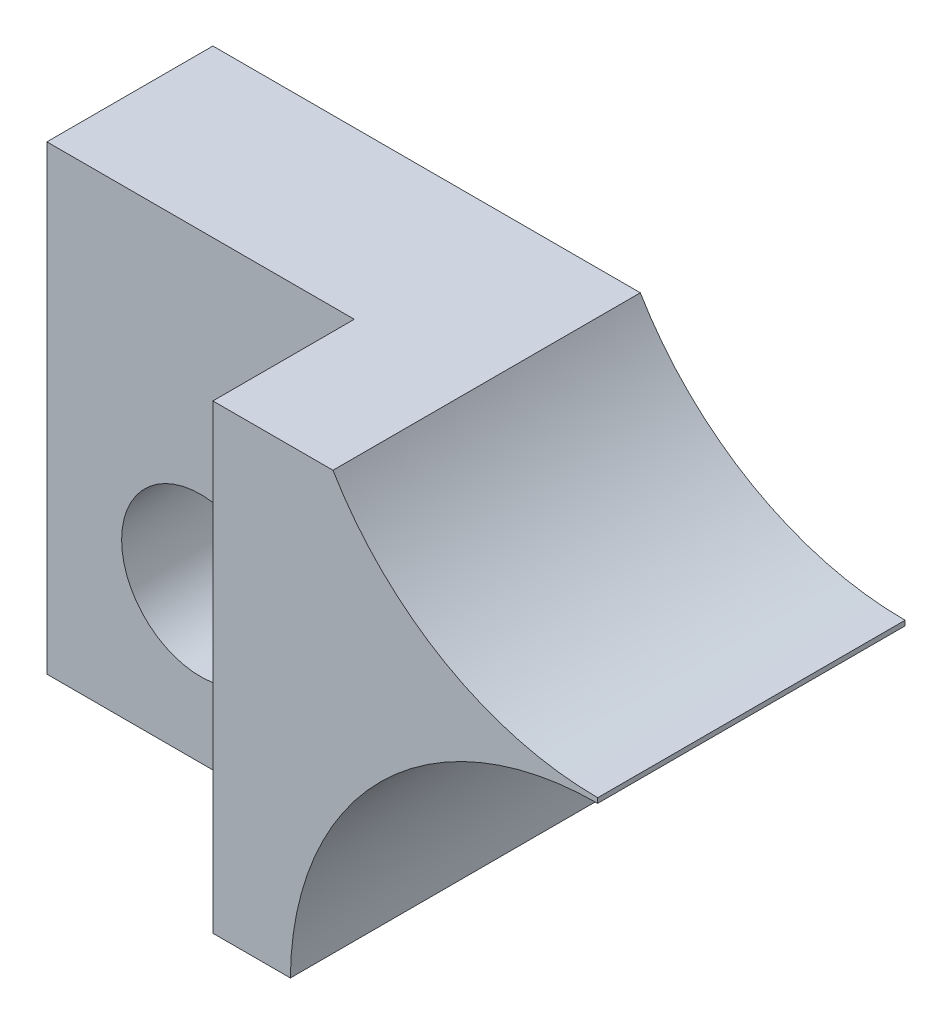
ISO-10303-21;
HEADER;
FILE_DESCRIPTION(('STEP AP214'),'2;1');
FILE_NAME('part.step','',(''),(''),'','','');
FILE_SCHEMA(('AUTOMOTIVE_DESIGN { 1 0 10303 214 1 1 1 1 }'));
ENDSEC;
DATA;
#1=APPLICATION_CONTEXT('core data for automotive mechanical design processes');
#2=APPLICATION_PROTOCOL_DEFINITION('international standard','automotive_design',2000,#1);
#3=PRODUCT_CONTEXT('',#1,'mechanical');
#4=PRODUCT('Part','Part','',(#3));
#5=PRODUCT_RELATED_PRODUCT_CATEGORY('part','',(#4));
#6=PRODUCT_DEFINITION_FORMATION('','',#4);
#7=PRODUCT_DEFINITION_CONTEXT('part definition',#1,'design');
#8=PRODUCT_DEFINITION('design','',#6,#7);
#9=PRODUCT_DEFINITION_SHAPE('','',#8);
#10=(LENGTH_UNIT() NAMED_UNIT(*) SI_UNIT(.MILLI.,.METRE.));
#11=(NAMED_UNIT(*) PLANE_ANGLE_UNIT() SI_UNIT($,.RADIAN.));
#12=(NAMED_UNIT(*) SI_UNIT($,.STERADIAN.) SOLID_ANGLE_UNIT());
#13=UNCERTAINTY_MEASURE_WITH_UNIT(LENGTH_MEASURE(1.E-05),#10,'distance_accuracy_value','');
#14=(GEOMETRIC_REPRESENTATION_CONTEXT(3) GLOBAL_UNCERTAINTY_ASSIGNED_CONTEXT((#13)) GLOBAL_UNIT_ASSIGNED_CONTEXT((#10,
#11,#12)) REPRESENTATION_CONTEXT('',''));
#15=CARTESIAN_POINT('',(0.,0.,0.));
#16=DIRECTION('',(0.,0.,1.));
#17=DIRECTION('',(1.,0.,0.));
#18=AXIS2_PLACEMENT_3D('',#15,#16,#17);
#19=CARTESIAN_POINT('',(-32.4430669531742,6.35000000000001,6.35));
#20=DIRECTION('',(0.,0.,-1.));
#21=DIRECTION('',(-1.,0.,0.));
#22=AXIS2_PLACEMENT_3D('',#19,#20,#21);
#23=PLANE('',#22);
#24=DIRECTION('',(0.,-1.,0.));
#25=VECTOR('',#24,1.);
#26=CARTESIAN_POINT('',(14.3002,6.35000000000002,6.35));
#27=LINE('',#26,#25);
#28=CARTESIAN_POINT('',(14.3002,6.4008,6.35));
#29=VERTEX_POINT('',#28);
#30=CARTESIAN_POINT('',(14.3002,6.2992,6.35));
#31=VERTEX_POINT('',#30);
#32=EDGE_CURVE('E110',#29,#31,#27,.T.);
#33=ORIENTED_EDGE('',*,*,#32,.F.);
#34=CARTESIAN_POINT('',(14.3002,12.7508,6.35));
#35=DIRECTION('',(0.,0.,-1.));
#36=DIRECTION('',(-1.,0.,0.));
#37=AXIS2_PLACEMENT_3D('',#34,#35,#36);
#38=CIRCLE('',#37,6.35);
#39=CARTESIAN_POINT('',(8.83058261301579,9.52499999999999,6.35));
#40=VERTEX_POINT('',#39);
#41=EDGE_CURVE('E109',#29,#40,#38,.T.);
#42=ORIENTED_EDGE('',*,*,#41,.T.);
#43=DIRECTION('',(-1.,0.,0.));
#44=VECTOR('',#43,1.);
#45=CARTESIAN_POINT('',(-32.4430669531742,9.525,6.35));
#46=LINE('',#45,#44);
#47=CARTESIAN_POINT('',(6.35,9.52499999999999,6.35));
#48=VERTEX_POINT('',#47);
#49=EDGE_CURVE('E134',#40,#48,#46,.T.);
#50=ORIENTED_EDGE('',*,*,#49,.T.);
#51=DIRECTION('',(0.,-1.,0.));
#52=VECTOR('',#51,1.);
#53=CARTESIAN_POINT('',(6.35,6.35000000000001,6.35));
#54=LINE('',#53,#52);
#55=CARTESIAN_POINT('',(6.34999999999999,0.,6.35));
#56=VERTEX_POINT('',#55);
#57=EDGE_CURVE('E11',#48,#56,#54,.T.);
#58=ORIENTED_EDGE('',*,*,#57,.T.);
#59=DIRECTION('',(-1.,0.,0.));
#60=VECTOR('',#59,1.);
#61=CARTESIAN_POINT('',(-32.4430669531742,0.,6.35));
#62=LINE('',#61,#60);
#63=CARTESIAN_POINT('',(7.9504032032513,0.,6.35));
#64=VERTEX_POINT('',#63);
#65=EDGE_CURVE('E130',#64,#56,#62,.T.);
#66=ORIENTED_EDGE('',*,*,#65,.F.);
#67=CARTESIAN_POINT('',(14.3002,-0.0508000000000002,6.35));
#68=DIRECTION('',(0.,0.,-1.));
#69=DIRECTION('',(-1.,0.,0.));
#70=AXIS2_PLACEMENT_3D('',#67,#68,#69);
#71=CIRCLE('',#70,6.35);
#72=EDGE_CURVE('E142',#64,#31,#71,.T.);
#73=ORIENTED_EDGE('',*,*,#72,.T.);
#74=EDGE_LOOP('',(#33,#42,#50,#58,#66,#73));
#75=FACE_BOUND('',#74,.T.);
#76=ADVANCED_FACE('F31',(#75),#23,.F.);
#77=CARTESIAN_POINT('',(14.3002,-0.0508000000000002,6.35));
#78=DIRECTION('',(0.,0.,-1.));
#79=DIRECTION('',(-1.,0.,0.));
#80=AXIS2_PLACEMENT_3D('',#77,#78,#79);
#81=CYLINDRICAL_SURFACE('',#80,6.35);
#82=DIRECTION('',(0.,0.,-1.));
#83=VECTOR('',#82,1.);
#84=CARTESIAN_POINT('',(14.3002,6.2992,6.35));
#85=LINE('',#84,#83);
#86=CARTESIAN_POINT('',(14.3002,6.2992,0.));
#87=VERTEX_POINT('',#86);
#88=EDGE_CURVE('E47',#31,#87,#85,.T.);
#89=ORIENTED_EDGE('',*,*,#88,.F.);
#90=ORIENTED_EDGE('',*,*,#72,.F.);
#91=DIRECTION('',(0.,0.,-1.));
#92=VECTOR('',#91,1.);
#93=CARTESIAN_POINT('',(7.9504032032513,0.,6.35));
#94=LINE('',#93,#92);
#95=CARTESIAN_POINT('',(7.9504032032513,0.,0.));
#96=VERTEX_POINT('',#95);
#97=EDGE_CURVE('E40',#64,#96,#94,.T.);
#98=ORIENTED_EDGE('',*,*,#97,.T.);
#99=CARTESIAN_POINT('',(14.3002,-0.0508000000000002,0.));
#100=DIRECTION('',(0.,0.,-1.));
#101=DIRECTION('',(-1.,0.,0.));
#102=AXIS2_PLACEMENT_3D('',#99,#100,#101);
#103=CIRCLE('',#102,6.35);
#104=EDGE_CURVE('E117',#96,#87,#103,.T.);
#105=ORIENTED_EDGE('',*,*,#104,.T.);
#106=EDGE_LOOP('',(#89,#90,#98,#105));
#107=FACE_BOUND('',#106,.T.);
#108=ADVANCED_FACE('F140',(#107),#81,.F.);
#109=CARTESIAN_POINT('',(14.3002,12.7508,6.35));
#110=DIRECTION('',(0.,0.,-1.));
#111=DIRECTION('',(-1.,0.,0.));
#112=AXIS2_PLACEMENT_3D('',#109,#110,#111);
#113=CYLINDRICAL_SURFACE('',#112,6.35);
#114=DIRECTION('',(0.,0.,-1.));
#115=VECTOR('',#114,1.);
#116=CARTESIAN_POINT('',(14.3002,6.4008,6.35));
#117=LINE('',#116,#115);
#118=CARTESIAN_POINT('',(14.3002,6.4008,0.));
#119=VERTEX_POINT('',#118);
#120=EDGE_CURVE('E96',#119,#29,#117,.F.);
#121=ORIENTED_EDGE('',*,*,#120,.F.);
#122=CARTESIAN_POINT('',(14.3002,12.7508,0.));
#123=DIRECTION('',(0.,0.,-1.));
#124=DIRECTION('',(-1.,0.,0.));
#125=AXIS2_PLACEMENT_3D('',#122,#123,#124);
#126=CIRCLE('',#125,6.35);
#127=CARTESIAN_POINT('',(8.83058261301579,9.52499999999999,0.));
#128=VERTEX_POINT('',#127);
#129=EDGE_CURVE('E107',#119,#128,#126,.T.);
#130=ORIENTED_EDGE('',*,*,#129,.T.);
#131=DIRECTION('',(0.,0.,-1.));
#132=VECTOR('',#131,1.);
#133=CARTESIAN_POINT('',(8.83058261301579,9.52499999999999,6.35));
#134=LINE('',#133,#132);
#135=EDGE_CURVE('E136',#40,#128,#134,.T.);
#136=ORIENTED_EDGE('',*,*,#135,.F.);
#137=ORIENTED_EDGE('',*,*,#41,.F.);
#138=EDGE_LOOP('',(#121,#130,#136,#137));
#139=FACE_BOUND('',#138,.T.);
#140=ADVANCED_FACE('F105',(#139),#113,.F.);
#141=CARTESIAN_POINT('',(-32.4430669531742,6.35000000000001,0.));
#142=DIRECTION('',(0.,0.,-1.));
#143=DIRECTION('',(-1.,0.,0.));
#144=AXIS2_PLACEMENT_3D('',#141,#142,#143);
#145=PLANE('',#144);
#146=CARTESIAN_POINT('',(3.175,3.175,0.));
#147=DIRECTION('',(0.,0.,-1.));
#148=DIRECTION('',(-1.,0.,0.));
#149=AXIS2_PLACEMENT_3D('',#146,#147,#148);
#150=CIRCLE('',#149,1.63195);
#151=CARTESIAN_POINT('',(1.54305,3.175,0.));
#152=VERTEX_POINT('',#151);
#153=EDGE_CURVE('E127',#152,#152,#150,.T.);
#154=ORIENTED_EDGE('',*,*,#153,.F.);
#155=EDGE_LOOP('',(#154));
#156=FACE_BOUND('',#155,.T.);
#157=ORIENTED_EDGE('',*,*,#129,.F.);
#158=DIRECTION('',(0.,-1.,0.));
#159=VECTOR('',#158,1.);
#160=CARTESIAN_POINT('',(14.3002,12.7508,0.));
#161=LINE('',#160,#159);
#162=EDGE_CURVE('E93',#119,#87,#161,.T.);
#163=ORIENTED_EDGE('',*,*,#162,.T.);
#164=ORIENTED_EDGE('',*,*,#104,.F.);
#165=DIRECTION('',(-1.,0.,0.));
#166=VECTOR('',#165,1.);
#167=CARTESIAN_POINT('',(-32.4430669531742,0.,0.));
#168=LINE('',#167,#166);
#169=CARTESIAN_POINT('',(0.,0.,0.));
#170=VERTEX_POINT('',#169);
#171=EDGE_CURVE('E121',#96,#170,#168,.T.);
#172=ORIENTED_EDGE('',*,*,#171,.T.);
#173=DIRECTION('',(0.,-1.,0.));
#174=VECTOR('',#173,1.);
#175=CARTESIAN_POINT('',(0.,6.35000000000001,0.));
#176=LINE('',#175,#174);
#177=CARTESIAN_POINT('',(0.,9.525,0.));
#178=VERTEX_POINT('',#177);
#179=EDGE_CURVE('E119',#178,#170,#176,.T.);
#180=ORIENTED_EDGE('',*,*,#179,.F.);
#181=DIRECTION('',(-1.,0.,0.));
#182=VECTOR('',#181,1.);
#183=CARTESIAN_POINT('',(-32.4430669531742,9.525,0.));
#184=LINE('',#183,#182);
#185=EDGE_CURVE('E116',#128,#178,#184,.T.);
#186=ORIENTED_EDGE('',*,*,#185,.F.);
#187=EDGE_LOOP('',(#157,#163,#164,#172,#180,#186));
#188=FACE_BOUND('',#187,.T.);
#189=ADVANCED_FACE('F113',(#156,#188),#145,.T.);
#190=CARTESIAN_POINT('',(-32.4430669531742,0.,6.35));
#191=DIRECTION('',(0.,-1.,0.));
#192=DIRECTION('',(0.,0.,-1.));
#193=AXIS2_PLACEMENT_3D('',#190,#191,#192);
#194=PLANE('',#193);
#195=DIRECTION('',(0.,0.,1.));
#196=VECTOR('',#195,1.);
#197=CARTESIAN_POINT('',(6.35,0.,6.35));
#198=LINE('',#197,#196);
#199=CARTESIAN_POINT('',(6.35,0.,3.429));
#200=VERTEX_POINT('',#199);
#201=EDGE_CURVE('E55',#200,#56,#198,.T.);
#202=ORIENTED_EDGE('',*,*,#201,.F.);
#203=DIRECTION('',(1.,0.,0.));
#204=VECTOR('',#203,1.);
#205=CARTESIAN_POINT('',(0.,0.,3.429));
#206=LINE('',#205,#204);
#207=CARTESIAN_POINT('',(0.,0.,3.429));
#208=VERTEX_POINT('',#207);
#209=EDGE_CURVE('E167',#208,#200,#206,.T.);
#210=ORIENTED_EDGE('',*,*,#209,.F.);
#211=DIRECTION('',(0.,0.,-1.));
#212=VECTOR('',#211,1.);
#213=CARTESIAN_POINT('',(0.,0.,6.35));
#214=LINE('',#213,#212);
#215=EDGE_CURVE('E131',#208,#170,#214,.T.);
#216=ORIENTED_EDGE('',*,*,#215,.T.);
#217=ORIENTED_EDGE('',*,*,#171,.F.);
#218=ORIENTED_EDGE('',*,*,#97,.F.);
#219=ORIENTED_EDGE('',*,*,#65,.T.);
#220=EDGE_LOOP('',(#202,#210,#216,#217,#218,#219));
#221=FACE_BOUND('',#220,.T.);
#222=ADVANCED_FACE('F33',(#221),#194,.T.);
#223=CARTESIAN_POINT('',(-32.4430669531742,9.525,6.35));
#224=DIRECTION('',(0.,-1.,0.));
#225=DIRECTION('',(0.,0.,-1.));
#226=AXIS2_PLACEMENT_3D('',#223,#224,#225);
#227=PLANE('',#226);
#228=DIRECTION('',(1.,0.,0.));
#229=VECTOR('',#228,1.);
#230=CARTESIAN_POINT('',(-32.4430669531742,9.525,3.429));
#231=LINE('',#230,#229);
#232=CARTESIAN_POINT('',(0.,9.525,3.429));
#233=VERTEX_POINT('',#232);
#234=CARTESIAN_POINT('',(6.35,9.525,3.429));
#235=VERTEX_POINT('',#234);
#236=EDGE_CURVE('E150',#233,#235,#231,.T.);
#237=ORIENTED_EDGE('',*,*,#236,.T.);
#238=DIRECTION('',(0.,0.,1.));
#239=VECTOR('',#238,1.);
#240=CARTESIAN_POINT('',(6.35,9.525,6.35000000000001));
#241=LINE('',#240,#239);
#242=EDGE_CURVE('E159',#235,#48,#241,.T.);
#243=ORIENTED_EDGE('',*,*,#242,.T.);
#244=ORIENTED_EDGE('',*,*,#49,.F.);
#245=ORIENTED_EDGE('',*,*,#135,.T.);
#246=ORIENTED_EDGE('',*,*,#185,.T.);
#247=DIRECTION('',(0.,0.,-1.));
#248=VECTOR('',#247,1.);
#249=CARTESIAN_POINT('',(0.,9.525,6.35));
#250=LINE('',#249,#248);
#251=EDGE_CURVE('E133',#233,#178,#250,.T.);
#252=ORIENTED_EDGE('',*,*,#251,.F.);
#253=EDGE_LOOP('',(#237,#243,#244,#245,#246,#252));
#254=FACE_BOUND('',#253,.T.);
#255=ADVANCED_FACE('F179',(#254),#227,.F.);
#256=CARTESIAN_POINT('',(0.,6.35000000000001,6.35));
#257=DIRECTION('',(1.,0.,0.));
#258=DIRECTION('',(0.,0.,-1.));
#259=AXIS2_PLACEMENT_3D('',#256,#257,#258);
#260=PLANE('',#259);
#261=ORIENTED_EDGE('',*,*,#215,.F.);
#262=DIRECTION('',(0.,-1.,0.));
#263=VECTOR('',#262,1.);
#264=CARTESIAN_POINT('',(0.,12.7,3.429));
#265=LINE('',#264,#263);
#266=EDGE_CURVE('E163',#233,#208,#265,.T.);
#267=ORIENTED_EDGE('',*,*,#266,.F.);
#268=ORIENTED_EDGE('',*,*,#251,.T.);
#269=ORIENTED_EDGE('',*,*,#179,.T.);
#270=EDGE_LOOP('',(#261,#267,#268,#269));
#271=FACE_BOUND('',#270,.T.);
#272=ADVANCED_FACE('F176',(#271),#260,.F.);
#273=CARTESIAN_POINT('',(3.175,3.175,6.35));
#274=DIRECTION('',(0.,0.,-1.));
#275=DIRECTION('',(-1.,0.,0.));
#276=AXIS2_PLACEMENT_3D('',#273,#274,#275);
#277=CYLINDRICAL_SURFACE('',#276,1.63195);
#278=CARTESIAN_POINT('',(3.175,3.175,3.429));
#279=DIRECTION('',(0.,0.,-1.));
#280=DIRECTION('',(-1.,0.,0.));
#281=AXIS2_PLACEMENT_3D('',#278,#279,#280);
#282=CIRCLE('',#281,1.63195);
#283=CARTESIAN_POINT('',(1.54305,3.175,3.429));
#284=VERTEX_POINT('',#283);
#285=EDGE_CURVE('E35',#284,#284,#282,.F.);
#286=ORIENTED_EDGE('',*,*,#285,.T.);
#287=EDGE_LOOP('',(#286));
#288=FACE_BOUND('',#287,.T.);
#289=ORIENTED_EDGE('',*,*,#153,.T.);
#290=EDGE_LOOP('',(#289));
#291=FACE_BOUND('',#290,.T.);
#292=ADVANCED_FACE('F184',(#288,#291),#277,.F.);
#293=CARTESIAN_POINT('',(0.,12.7,3.429));
#294=DIRECTION('',(0.,0.,-1.));
#295=DIRECTION('',(-1.,0.,0.));
#296=AXIS2_PLACEMENT_3D('',#293,#294,#295);
#297=PLANE('',#296);
#298=ORIENTED_EDGE('',*,*,#285,.F.);
#299=EDGE_LOOP('',(#298));
#300=FACE_BOUND('',#299,.T.);
#301=ORIENTED_EDGE('',*,*,#266,.T.);
#302=ORIENTED_EDGE('',*,*,#209,.T.);
#303=DIRECTION('',(0.,-1.,0.));
#304=VECTOR('',#303,1.);
#305=CARTESIAN_POINT('',(6.35,12.7,3.429));
#306=LINE('',#305,#304);
#307=EDGE_CURVE('E162',#235,#200,#306,.T.);
#308=ORIENTED_EDGE('',*,*,#307,.F.);
#309=ORIENTED_EDGE('',*,*,#236,.F.);
#310=EDGE_LOOP('',(#301,#302,#308,#309));
#311=FACE_BOUND('',#310,.T.);
#312=ADVANCED_FACE('F182',(#300,#311),#297,.F.);
#313=CARTESIAN_POINT('',(6.35,12.7,6.35));
#314=DIRECTION('',(1.,0.,0.));
#315=DIRECTION('',(0.,0.,-1.));
#316=AXIS2_PLACEMENT_3D('',#313,#314,#315);
#317=PLANE('',#316);
#318=ORIENTED_EDGE('',*,*,#307,.T.);
#319=ORIENTED_EDGE('',*,*,#201,.T.);
#320=ORIENTED_EDGE('',*,*,#57,.F.);
#321=ORIENTED_EDGE('',*,*,#242,.F.);
#322=EDGE_LOOP('',(#318,#319,#320,#321));
#323=FACE_BOUND('',#322,.T.);
#324=ADVANCED_FACE('F181',(#323),#317,.F.);
#325=CARTESIAN_POINT('',(14.3002,12.7508,16.35));
#326=DIRECTION('',(1.,0.,0.));
#327=DIRECTION('',(0.,1.,0.));
#328=AXIS2_PLACEMENT_3D('',#325,#326,#327);
#329=PLANE('',#328);
#330=ORIENTED_EDGE('',*,*,#88,.T.);
#331=ORIENTED_EDGE('',*,*,#162,.F.);
#332=ORIENTED_EDGE('',*,*,#120,.T.);
#333=ORIENTED_EDGE('',*,*,#32,.T.);
#334=EDGE_LOOP('',(#330,#331,#332,#333));
#335=FACE_BOUND('',#334,.T.);
#336=ADVANCED_FACE('F95',(#335),#329,.T.);
#337=CLOSED_SHELL('',(#76,#108,#140,#189,#222,#255,#272,#292,#312,#324,#336));
#338=MANIFOLD_SOLID_BREP('B2',#337);
#339=ADVANCED_BREP_SHAPE_REPRESENTATION('',(#18,#338),#14);
#340=SHAPE_DEFINITION_REPRESENTATION(#9,#339);
ENDSEC;
END-ISO-10303-21;
